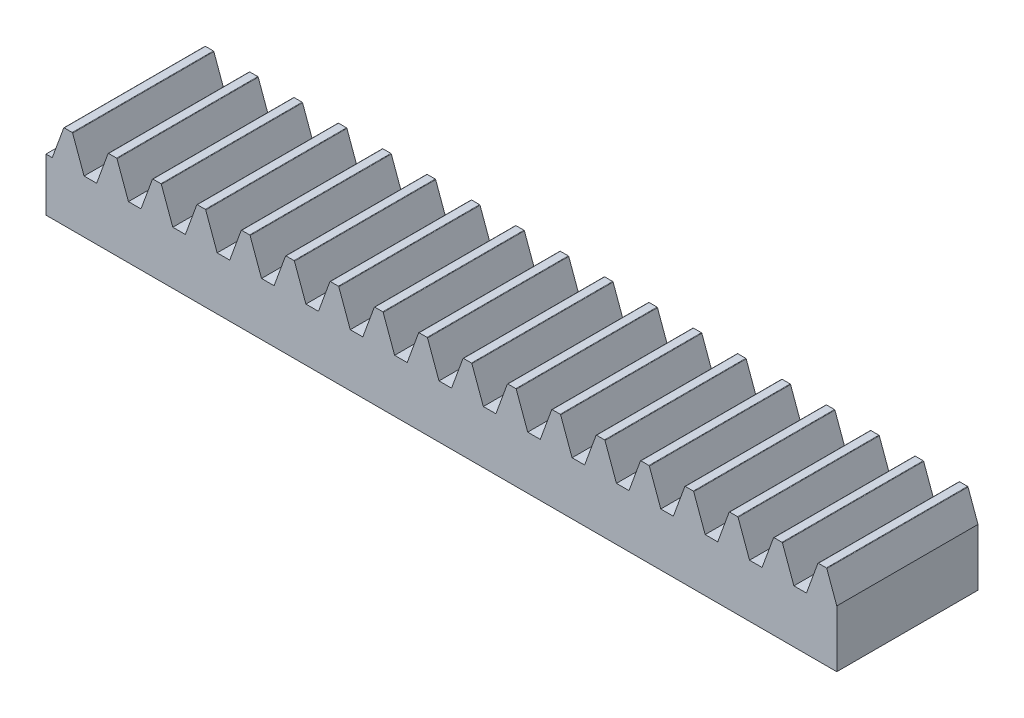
from build123d import *

# Parameters (mm, degrees)
BLANKSKE_W        = 56
BLANKSKE_H        = 6
BLANK_DEPTH       = 10
TOOTHCUTILL_DEPTH = 58.201398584
TOOTHCUTSIM_DEPTH = 58.201398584
TEETHCUTS_COUNT   = 24
TEETHCUTS_PITCH   = 3.14159265


with BuildPart() as part:
    # BlankSke → Blank (new body)
    with BuildSketch(Plane.XY):
        with Locations((28, 3)):
            Rectangle(BLANKSKE_W, BLANKSKE_H)
    extrude(amount=-BLANK_DEPTH)

    # TooCutSkeIll → ToothCutIll (cut, through all)
    with BuildSketch(Plane.XY):
        with BuildLine():
            Line((-1.253788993, 5.973680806), (-0.504546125, 3.915152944))
            ThreePointArc((-0.504546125, 3.915152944), (-0.412650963, 3.795392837), (-0.268683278, 3.75))
            Line((-0.268683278, 3.75), (0.268683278, 3.75))
            ThreePointArc((0.268683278, 3.75), (0.412650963, 3.795392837), (0.504546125, 3.915152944))
            Line((0.504546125, 3.915152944), (1.253788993, 5.973680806))
            ThreePointArc((1.253788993, 5.973680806), (1.268433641, 5.992766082), (1.291376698, 6))
            Line((1.291376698, 6), (1.291376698, 6.0254))
            Line((1.291376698, 6.0254), (-1.291376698, 6.0254))
            Line((-1.291376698, 6.0254), (-1.291376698, 6))
            ThreePointArc((-1.291376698, 6), (-1.268433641, 5.992766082), (-1.253788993, 5.973680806))
        make_face()
    toothcutill = extrude(amount=-TOOTHCUTILL_DEPTH, mode=Mode.SUBTRACT)

    # TooCutSkeSim → ToothCutSim (cut, through all)
    with BuildSketch(Plane.XY):
        Polygon((0.44443537, 3.75), (-0.44443537, 3.75), (-1.272613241, 6.0254), (1.272613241, 6.0254), align=None)
    toothcutsim = extrude(amount=-TOOTHCUTSIM_DEPTH, mode=Mode.SUBTRACT)

    # TeethCuts: ToothCutIll, ToothCutSim ×24
    with Locations(*[(i * TEETHCUTS_PITCH, 0, 0) for i in range(1, TEETHCUTS_COUNT)]):
        add(toothcutill, mode=Mode.SUBTRACT)
        add(toothcutsim, mode=Mode.SUBTRACT)


solid = part.part
